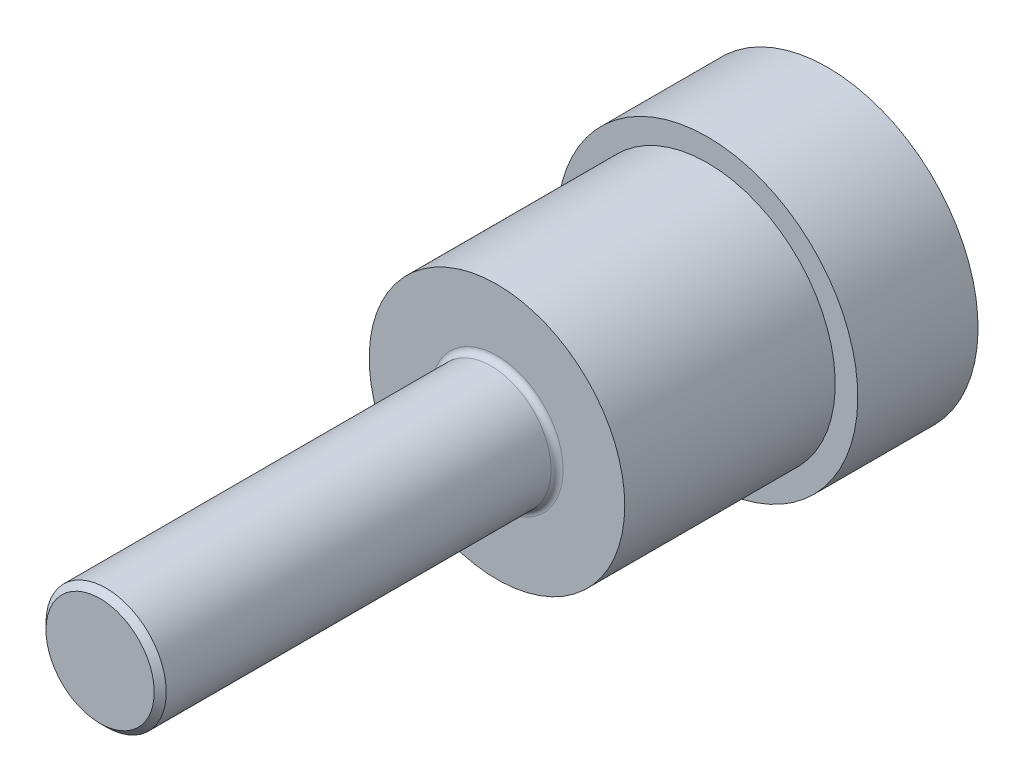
ISO-10303-21;
HEADER;
FILE_DESCRIPTION(('STEP AP214'),'2;1');
FILE_NAME('part.step','',(''),(''),'','','');
FILE_SCHEMA(('AUTOMOTIVE_DESIGN { 1 0 10303 214 1 1 1 1 }'));
ENDSEC;
DATA;
#1=APPLICATION_CONTEXT('core data for automotive mechanical design processes');
#2=APPLICATION_PROTOCOL_DEFINITION('international standard','automotive_design',2000,#1);
#3=PRODUCT_CONTEXT('',#1,'mechanical');
#4=PRODUCT('Part','Part','',(#3));
#5=PRODUCT_RELATED_PRODUCT_CATEGORY('part','',(#4));
#6=PRODUCT_DEFINITION_FORMATION('','',#4);
#7=PRODUCT_DEFINITION_CONTEXT('part definition',#1,'design');
#8=PRODUCT_DEFINITION('design','',#6,#7);
#9=PRODUCT_DEFINITION_SHAPE('','',#8);
#10=(LENGTH_UNIT() NAMED_UNIT(*) SI_UNIT(.MILLI.,.METRE.));
#11=(NAMED_UNIT(*) PLANE_ANGLE_UNIT() SI_UNIT($,.RADIAN.));
#12=(NAMED_UNIT(*) SI_UNIT($,.STERADIAN.) SOLID_ANGLE_UNIT());
#13=UNCERTAINTY_MEASURE_WITH_UNIT(LENGTH_MEASURE(1.E-05),#10,'distance_accuracy_value','');
#14=(GEOMETRIC_REPRESENTATION_CONTEXT(3) GLOBAL_UNCERTAINTY_ASSIGNED_CONTEXT((#13)) GLOBAL_UNIT_ASSIGNED_CONTEXT((#10,
#11,#12)) REPRESENTATION_CONTEXT('',''));
#15=CARTESIAN_POINT('',(0.,0.,0.));
#16=DIRECTION('',(0.,0.,1.));
#17=DIRECTION('',(1.,0.,0.));
#18=AXIS2_PLACEMENT_3D('',#15,#16,#17);
#19=CARTESIAN_POINT('',(0.,0.,-2.));
#20=DIRECTION('',(0.,0.,-1.));
#21=DIRECTION('',(0.,-1.,0.));
#22=AXIS2_PLACEMENT_3D('',#19,#20,#21);
#23=PLANE('',#22);
#24=CARTESIAN_POINT('',(0.,0.,-2.));
#25=DIRECTION('',(0.,0.,-1.));
#26=DIRECTION('',(0.,1.,0.));
#27=AXIS2_PLACEMENT_3D('',#24,#25,#26);
#28=CIRCLE('',#27,4.25);
#29=CARTESIAN_POINT('',(0.,4.25,-2.));
#30=VERTEX_POINT('',#29);
#31=EDGE_CURVE('E9',#30,#30,#28,.F.);
#32=ORIENTED_EDGE('',*,*,#31,.F.);
#33=EDGE_LOOP('',(#32));
#34=FACE_BOUND('',#33,.T.);
#35=CARTESIAN_POINT('',(0.,0.,-2.));
#36=DIRECTION('',(0.,0.,-1.));
#37=DIRECTION('',(0.,1.,0.));
#38=AXIS2_PLACEMENT_3D('',#35,#36,#37);
#39=CIRCLE('',#38,5.);
#40=CARTESIAN_POINT('',(0.,5.,-2.));
#41=VERTEX_POINT('',#40);
#42=EDGE_CURVE('E104',#41,#41,#39,.T.);
#43=ORIENTED_EDGE('',*,*,#42,.F.);
#44=EDGE_LOOP('',(#43));
#45=FACE_BOUND('',#44,.T.);
#46=ADVANCED_FACE('F14',(#34,#45),#23,.F.);
#47=CARTESIAN_POINT('',(0.,0.,-6.));
#48=DIRECTION('',(0.,0.,1.));
#49=DIRECTION('',(0.,1.,0.));
#50=AXIS2_PLACEMENT_3D('',#47,#48,#49);
#51=CYLINDRICAL_SURFACE('',#50,5.);
#52=CARTESIAN_POINT('',(0.,0.,-6.));
#53=DIRECTION('',(0.,0.,-1.));
#54=DIRECTION('',(0.,1.,0.));
#55=AXIS2_PLACEMENT_3D('',#52,#53,#54);
#56=CIRCLE('',#55,5.);
#57=CARTESIAN_POINT('',(0.,5.,-6.));
#58=VERTEX_POINT('',#57);
#59=EDGE_CURVE('E222',#58,#58,#56,.T.);
#60=ORIENTED_EDGE('',*,*,#59,.F.);
#61=EDGE_LOOP('',(#60));
#62=FACE_BOUND('',#61,.T.);
#63=ORIENTED_EDGE('',*,*,#42,.T.);
#64=EDGE_LOOP('',(#63));
#65=FACE_BOUND('',#64,.T.);
#66=ADVANCED_FACE('F166',(#62,#65),#51,.T.);
#67=CARTESIAN_POINT('',(0.,0.,-6.));
#68=DIRECTION('',(0.,0.,-1.));
#69=DIRECTION('',(0.,-1.,0.));
#70=AXIS2_PLACEMENT_3D('',#67,#68,#69);
#71=PLANE('',#70);
#72=CARTESIAN_POINT('',(0.,0.,-6.));
#73=DIRECTION('',(0.,0.,-1.));
#74=DIRECTION('',(0.,1.,0.));
#75=AXIS2_PLACEMENT_3D('',#72,#73,#74);
#76=CIRCLE('',#75,3.);
#77=CARTESIAN_POINT('',(0.,3.,-6.));
#78=VERTEX_POINT('',#77);
#79=EDGE_CURVE('E219',#78,#78,#76,.T.);
#80=ORIENTED_EDGE('',*,*,#79,.F.);
#81=EDGE_LOOP('',(#80));
#82=FACE_BOUND('',#81,.T.);
#83=ORIENTED_EDGE('',*,*,#59,.T.);
#84=EDGE_LOOP('',(#83));
#85=FACE_BOUND('',#84,.T.);
#86=ADVANCED_FACE('F173',(#82,#85),#71,.T.);
#87=CARTESIAN_POINT('',(0.,0.,-3.5));
#88=DIRECTION('',(0.,0.,-1.));
#89=DIRECTION('',(-1.,0.,0.));
#90=AXIS2_PLACEMENT_3D('',#87,#88,#89);
#91=PLANE('',#90);
#92=DIRECTION('',(0.866025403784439,0.5,0.));
#93=VECTOR('',#92,1.);
#94=CARTESIAN_POINT('',(-1.,0.577350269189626,-3.5));
#95=LINE('',#94,#93);
#96=CARTESIAN_POINT('',(-1.,0.577350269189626,-3.5));
#97=VERTEX_POINT('',#96);
#98=CARTESIAN_POINT('',(0.,1.15470053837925,-3.5));
#99=VERTEX_POINT('',#98);
#100=EDGE_CURVE('E115',#97,#99,#95,.T.);
#101=ORIENTED_EDGE('',*,*,#100,.T.);
#102=DIRECTION('',(0.866025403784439,-0.5,0.));
#103=VECTOR('',#102,1.);
#104=CARTESIAN_POINT('',(0.,1.15470053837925,-3.5));
#105=LINE('',#104,#103);
#106=CARTESIAN_POINT('',(1.,0.577350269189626,-3.5));
#107=VERTEX_POINT('',#106);
#108=EDGE_CURVE('E97',#99,#107,#105,.T.);
#109=ORIENTED_EDGE('',*,*,#108,.T.);
#110=DIRECTION('',(0.,-1.,0.));
#111=VECTOR('',#110,1.);
#112=CARTESIAN_POINT('',(1.,0.577350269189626,-3.5));
#113=LINE('',#112,#111);
#114=CARTESIAN_POINT('',(1.,-0.577350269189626,-3.5));
#115=VERTEX_POINT('',#114);
#116=EDGE_CURVE('E95',#107,#115,#113,.T.);
#117=ORIENTED_EDGE('',*,*,#116,.T.);
#118=DIRECTION('',(-0.866025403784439,-0.5,0.));
#119=VECTOR('',#118,1.);
#120=CARTESIAN_POINT('',(1.,-0.577350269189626,-3.5));
#121=LINE('',#120,#119);
#122=CARTESIAN_POINT('',(0.,-1.15470053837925,-3.5));
#123=VERTEX_POINT('',#122);
#124=EDGE_CURVE('E74',#115,#123,#121,.T.);
#125=ORIENTED_EDGE('',*,*,#124,.T.);
#126=DIRECTION('',(-0.866025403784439,0.5,0.));
#127=VECTOR('',#126,1.);
#128=CARTESIAN_POINT('',(0.,-1.15470053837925,-3.5));
#129=LINE('',#128,#127);
#130=CARTESIAN_POINT('',(-1.,-0.577350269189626,-3.5));
#131=VERTEX_POINT('',#130);
#132=EDGE_CURVE('E85',#123,#131,#129,.T.);
#133=ORIENTED_EDGE('',*,*,#132,.T.);
#134=DIRECTION('',(0.,1.,0.));
#135=VECTOR('',#134,1.);
#136=CARTESIAN_POINT('',(-1.,-0.577350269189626,-3.5));
#137=LINE('',#136,#135);
#138=EDGE_CURVE('E89',#131,#97,#137,.T.);
#139=ORIENTED_EDGE('',*,*,#138,.T.);
#140=EDGE_LOOP('',(#101,#109,#117,#125,#133,#139));
#141=FACE_BOUND('',#140,.T.);
#142=ADVANCED_FACE('F92',(#141),#91,.T.);
#143=CARTESIAN_POINT('',(0.,1.15470053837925,-3.5));
#144=DIRECTION('',(0.5,0.866025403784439,0.));
#145=DIRECTION('',(0.866025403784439,-0.5,0.));
#146=AXIS2_PLACEMENT_3D('',#143,#144,#145);
#147=PLANE('',#146);
#148=DIRECTION('',(0.866025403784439,-0.5,0.));
#149=VECTOR('',#148,1.);
#150=CARTESIAN_POINT('',(0.,1.15470053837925,-5.));
#151=LINE('',#150,#149);
#152=CARTESIAN_POINT('',(0.,1.15470053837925,-5.));
#153=VERTEX_POINT('',#152);
#154=CARTESIAN_POINT('',(1.,0.577350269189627,-5.));
#155=VERTEX_POINT('',#154);
#156=EDGE_CURVE('E103',#153,#155,#151,.T.);
#157=ORIENTED_EDGE('',*,*,#156,.T.);
#158=DIRECTION('',(0.,0.,-1.));
#159=VECTOR('',#158,1.);
#160=CARTESIAN_POINT('',(1.,0.577350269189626,-3.5));
#161=LINE('',#160,#159);
#162=EDGE_CURVE('E120',#107,#155,#161,.T.);
#163=ORIENTED_EDGE('',*,*,#162,.F.);
#164=ORIENTED_EDGE('',*,*,#108,.F.);
#165=DIRECTION('',(0.,0.,-1.));
#166=VECTOR('',#165,1.);
#167=CARTESIAN_POINT('',(0.,1.15470053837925,-3.5));
#168=LINE('',#167,#166);
#169=EDGE_CURVE('E59',#99,#153,#168,.T.);
#170=ORIENTED_EDGE('',*,*,#169,.T.);
#171=EDGE_LOOP('',(#157,#163,#164,#170));
#172=FACE_BOUND('',#171,.T.);
#173=ADVANCED_FACE('F144',(#172),#147,.F.);
#174=CARTESIAN_POINT('',(1.,0.577350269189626,-3.5));
#175=DIRECTION('',(1.,0.,0.));
#176=DIRECTION('',(0.,0.,-1.));
#177=AXIS2_PLACEMENT_3D('',#174,#175,#176);
#178=PLANE('',#177);
#179=DIRECTION('',(0.,-1.,0.));
#180=VECTOR('',#179,1.);
#181=CARTESIAN_POINT('',(1.,0.577350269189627,-5.));
#182=LINE('',#181,#180);
#183=CARTESIAN_POINT('',(1.,-0.577350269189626,-5.));
#184=VERTEX_POINT('',#183);
#185=EDGE_CURVE('E107',#155,#184,#182,.T.);
#186=ORIENTED_EDGE('',*,*,#185,.T.);
#187=DIRECTION('',(0.,0.,-1.));
#188=VECTOR('',#187,1.);
#189=CARTESIAN_POINT('',(1.,-0.577350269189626,-3.5));
#190=LINE('',#189,#188);
#191=EDGE_CURVE('E82',#115,#184,#190,.T.);
#192=ORIENTED_EDGE('',*,*,#191,.F.);
#193=ORIENTED_EDGE('',*,*,#116,.F.);
#194=ORIENTED_EDGE('',*,*,#162,.T.);
#195=EDGE_LOOP('',(#186,#192,#193,#194));
#196=FACE_BOUND('',#195,.T.);
#197=ADVANCED_FACE('F148',(#196),#178,.F.);
#198=CARTESIAN_POINT('',(1.,-0.577350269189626,-3.5));
#199=DIRECTION('',(0.5,-0.866025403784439,0.));
#200=DIRECTION('',(-0.866025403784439,-0.5,0.));
#201=AXIS2_PLACEMENT_3D('',#198,#199,#200);
#202=PLANE('',#201);
#203=DIRECTION('',(-0.866025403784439,-0.5,0.));
#204=VECTOR('',#203,1.);
#205=CARTESIAN_POINT('',(1.,-0.577350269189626,-5.));
#206=LINE('',#205,#204);
#207=CARTESIAN_POINT('',(0.,-1.15470053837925,-5.));
#208=VERTEX_POINT('',#207);
#209=EDGE_CURVE('E77',#184,#208,#206,.T.);
#210=ORIENTED_EDGE('',*,*,#209,.T.);
#211=DIRECTION('',(0.,0.,-1.));
#212=VECTOR('',#211,1.);
#213=CARTESIAN_POINT('',(0.,-1.15470053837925,-3.5));
#214=LINE('',#213,#212);
#215=EDGE_CURVE('E70',#123,#208,#214,.T.);
#216=ORIENTED_EDGE('',*,*,#215,.F.);
#217=ORIENTED_EDGE('',*,*,#124,.F.);
#218=ORIENTED_EDGE('',*,*,#191,.T.);
#219=EDGE_LOOP('',(#210,#216,#217,#218));
#220=FACE_BOUND('',#219,.T.);
#221=ADVANCED_FACE('F72',(#220),#202,.F.);
#222=CARTESIAN_POINT('',(0.,-1.15470053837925,-3.5));
#223=DIRECTION('',(-0.5,-0.866025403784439,0.));
#224=DIRECTION('',(-0.866025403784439,0.5,0.));
#225=AXIS2_PLACEMENT_3D('',#222,#223,#224);
#226=PLANE('',#225);
#227=DIRECTION('',(-0.866025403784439,0.5,0.));
#228=VECTOR('',#227,1.);
#229=CARTESIAN_POINT('',(0.,-1.15470053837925,-5.));
#230=LINE('',#229,#228);
#231=CARTESIAN_POINT('',(-1.,-0.577350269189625,-5.));
#232=VERTEX_POINT('',#231);
#233=EDGE_CURVE('E111',#208,#232,#230,.T.);
#234=ORIENTED_EDGE('',*,*,#233,.T.);
#235=DIRECTION('',(0.,0.,-1.));
#236=VECTOR('',#235,1.);
#237=CARTESIAN_POINT('',(-1.,-0.577350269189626,-3.5));
#238=LINE('',#237,#236);
#239=EDGE_CURVE('E81',#131,#232,#238,.T.);
#240=ORIENTED_EDGE('',*,*,#239,.F.);
#241=ORIENTED_EDGE('',*,*,#132,.F.);
#242=ORIENTED_EDGE('',*,*,#215,.T.);
#243=EDGE_LOOP('',(#234,#240,#241,#242));
#244=FACE_BOUND('',#243,.T.);
#245=ADVANCED_FACE('F86',(#244),#226,.F.);
#246=CARTESIAN_POINT('',(-1.,-0.577350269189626,-3.5));
#247=DIRECTION('',(-1.,0.,0.));
#248=DIRECTION('',(0.,0.,1.));
#249=AXIS2_PLACEMENT_3D('',#246,#247,#248);
#250=PLANE('',#249);
#251=DIRECTION('',(0.,1.,0.));
#252=VECTOR('',#251,1.);
#253=CARTESIAN_POINT('',(-1.,-0.577350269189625,-5.));
#254=LINE('',#253,#252);
#255=CARTESIAN_POINT('',(-1.,0.577350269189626,-5.));
#256=VERTEX_POINT('',#255);
#257=EDGE_CURVE('E113',#232,#256,#254,.T.);
#258=ORIENTED_EDGE('',*,*,#257,.T.);
#259=DIRECTION('',(0.,0.,-1.));
#260=VECTOR('',#259,1.);
#261=CARTESIAN_POINT('',(-1.,0.577350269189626,-3.5));
#262=LINE('',#261,#260);
#263=EDGE_CURVE('E37',#97,#256,#262,.T.);
#264=ORIENTED_EDGE('',*,*,#263,.F.);
#265=ORIENTED_EDGE('',*,*,#138,.F.);
#266=ORIENTED_EDGE('',*,*,#239,.T.);
#267=EDGE_LOOP('',(#258,#264,#265,#266));
#268=FACE_BOUND('',#267,.T.);
#269=ADVANCED_FACE('F152',(#268),#250,.F.);
#270=CARTESIAN_POINT('',(-1.,0.577350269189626,-3.5));
#271=DIRECTION('',(-0.5,0.866025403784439,0.));
#272=DIRECTION('',(0.866025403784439,0.5,0.));
#273=AXIS2_PLACEMENT_3D('',#270,#271,#272);
#274=PLANE('',#273);
#275=DIRECTION('',(0.866025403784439,0.5,0.));
#276=VECTOR('',#275,1.);
#277=CARTESIAN_POINT('',(-1.,0.577350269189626,-5.));
#278=LINE('',#277,#276);
#279=EDGE_CURVE('E29',#256,#153,#278,.T.);
#280=ORIENTED_EDGE('',*,*,#279,.T.);
#281=ORIENTED_EDGE('',*,*,#169,.F.);
#282=ORIENTED_EDGE('',*,*,#100,.F.);
#283=ORIENTED_EDGE('',*,*,#263,.T.);
#284=EDGE_LOOP('',(#280,#281,#282,#283));
#285=FACE_BOUND('',#284,.T.);
#286=ADVANCED_FACE('F154',(#285),#274,.F.);
#287=CARTESIAN_POINT('',(0.,0.,-5.));
#288=DIRECTION('',(0.,0.,-1.));
#289=DIRECTION('',(-1.,0.,0.));
#290=AXIS2_PLACEMENT_3D('',#287,#288,#289);
#291=PLANE('',#290);
#292=ORIENTED_EDGE('',*,*,#279,.F.);
#293=ORIENTED_EDGE('',*,*,#257,.F.);
#294=ORIENTED_EDGE('',*,*,#233,.F.);
#295=ORIENTED_EDGE('',*,*,#209,.F.);
#296=ORIENTED_EDGE('',*,*,#185,.F.);
#297=ORIENTED_EDGE('',*,*,#156,.F.);
#298=EDGE_LOOP('',(#292,#293,#294,#295,#296,#297));
#299=FACE_BOUND('',#298,.T.);
#300=CARTESIAN_POINT('',(0.,0.,-5.));
#301=DIRECTION('',(0.,0.,-1.));
#302=DIRECTION('',(-1.,0.,0.));
#303=AXIS2_PLACEMENT_3D('',#300,#301,#302);
#304=CIRCLE('',#303,2.75);
#305=CARTESIAN_POINT('',(-2.75,0.,-5.00000000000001));
#306=VERTEX_POINT('',#305);
#307=EDGE_CURVE('E117',#306,#306,#304,.T.);
#308=ORIENTED_EDGE('',*,*,#307,.T.);
#309=EDGE_LOOP('',(#308));
#310=FACE_BOUND('',#309,.T.);
#311=ADVANCED_FACE('F150',(#299,#310),#291,.T.);
#312=CARTESIAN_POINT('',(0.,0.,-11.));
#313=DIRECTION('',(0.,0.,-1.));
#314=DIRECTION('',(-1.,0.,0.));
#315=AXIS2_PLACEMENT_3D('',#312,#313,#314);
#316=CYLINDRICAL_SURFACE('',#315,2.75);
#317=CARTESIAN_POINT('',(0.,0.,-3.));
#318=DIRECTION('',(0.,0.,-1.));
#319=DIRECTION('',(0.,1.,0.));
#320=AXIS2_PLACEMENT_3D('',#317,#318,#319);
#321=CIRCLE('',#320,2.75);
#322=CARTESIAN_POINT('',(0.,2.75,-3.));
#323=VERTEX_POINT('',#322);
#324=EDGE_CURVE('E22',#323,#323,#321,.T.);
#325=ORIENTED_EDGE('',*,*,#324,.T.);
#326=EDGE_LOOP('',(#325));
#327=FACE_BOUND('',#326,.T.);
#328=ORIENTED_EDGE('',*,*,#307,.F.);
#329=EDGE_LOOP('',(#328));
#330=FACE_BOUND('',#329,.T.);
#331=ADVANCED_FACE('F16',(#327,#330),#316,.T.);
#332=CARTESIAN_POINT('',(0.,0.,-3.));
#333=DIRECTION('',(0.,0.,-1.));
#334=DIRECTION('',(0.,-1.,0.));
#335=AXIS2_PLACEMENT_3D('',#332,#333,#334);
#336=PLANE('',#335);
#337=ORIENTED_EDGE('',*,*,#324,.F.);
#338=EDGE_LOOP('',(#337));
#339=FACE_BOUND('',#338,.T.);
#340=CARTESIAN_POINT('',(0.,0.,-3.));
#341=DIRECTION('',(0.,0.,-1.));
#342=DIRECTION('',(0.,-1.,0.));
#343=AXIS2_PLACEMENT_3D('',#340,#341,#342);
#344=CIRCLE('',#343,3.);
#345=CARTESIAN_POINT('',(0.,-3.,-3.));
#346=VERTEX_POINT('',#345);
#347=EDGE_CURVE('E142',#346,#346,#344,.T.);
#348=ORIENTED_EDGE('',*,*,#347,.T.);
#349=EDGE_LOOP('',(#348));
#350=FACE_BOUND('',#349,.T.);
#351=ADVANCED_FACE('F236',(#339,#350),#336,.T.);
#352=CARTESIAN_POINT('',(0.,0.,-3.));
#353=DIRECTION('',(0.,0.,-1.));
#354=DIRECTION('',(0.,-1.,0.));
#355=AXIS2_PLACEMENT_3D('',#352,#353,#354);
#356=CYLINDRICAL_SURFACE('',#355,3.);
#357=ORIENTED_EDGE('',*,*,#347,.F.);
#358=EDGE_LOOP('',(#357));
#359=FACE_BOUND('',#358,.T.);
#360=ORIENTED_EDGE('',*,*,#79,.T.);
#361=EDGE_LOOP('',(#360));
#362=FACE_BOUND('',#361,.T.);
#363=ADVANCED_FACE('F185',(#359,#362),#356,.F.);
#364=CARTESIAN_POINT('',(0.,0.,-2.));
#365=DIRECTION('',(0.,0.,-1.));
#366=DIRECTION('',(0.,1.,0.));
#367=AXIS2_PLACEMENT_3D('',#364,#365,#366);
#368=CYLINDRICAL_SURFACE('',#367,4.25);
#369=ORIENTED_EDGE('',*,*,#31,.T.);
#370=EDGE_LOOP('',(#369));
#371=FACE_BOUND('',#370,.T.);
#372=CARTESIAN_POINT('',(0.,0.,5.));
#373=DIRECTION('',(0.,0.,1.));
#374=DIRECTION('',(1.,0.,0.));
#375=AXIS2_PLACEMENT_3D('',#372,#373,#374);
#376=CIRCLE('',#375,4.25);
#377=CARTESIAN_POINT('',(4.25,0.,5.));
#378=VERTEX_POINT('',#377);
#379=EDGE_CURVE('E226',#378,#378,#376,.T.);
#380=ORIENTED_EDGE('',*,*,#379,.F.);
#381=EDGE_LOOP('',(#380));
#382=FACE_BOUND('',#381,.T.);
#383=ADVANCED_FACE('F181',(#371,#382),#368,.T.);
#384=CARTESIAN_POINT('',(0.,0.,18.2));
#385=DIRECTION('',(0.,0.,1.));
#386=DIRECTION('',(0.,-1.,0.));
#387=AXIS2_PLACEMENT_3D('',#384,#385,#386);
#388=PLANE('',#387);
#389=CARTESIAN_POINT('',(0.,0.,18.2));
#390=DIRECTION('',(0.,0.,1.));
#391=DIRECTION('',(0.,-1.,0.));
#392=AXIS2_PLACEMENT_3D('',#389,#390,#391);
#393=CIRCLE('',#392,1.8);
#394=CARTESIAN_POINT('',(0.,-1.8,18.2));
#395=VERTEX_POINT('',#394);
#396=EDGE_CURVE('E127',#395,#395,#393,.T.);
#397=ORIENTED_EDGE('',*,*,#396,.T.);
#398=EDGE_LOOP('',(#397));
#399=FACE_BOUND('',#398,.T.);
#400=ADVANCED_FACE('F184',(#399),#388,.T.);
#401=CARTESIAN_POINT('',(0.,0.,18.));
#402=DIRECTION('',(0.,0.,-1.));
#403=DIRECTION('',(0.,1.,0.));
#404=AXIS2_PLACEMENT_3D('',#401,#402,#403);
#405=CONICAL_SURFACE('',#404,2.,0.785398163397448);
#406=ORIENTED_EDGE('',*,*,#396,.F.);
#407=EDGE_LOOP('',(#406));
#408=FACE_BOUND('',#407,.T.);
#409=CARTESIAN_POINT('',(0.,0.,18.));
#410=DIRECTION('',(0.,0.,1.));
#411=DIRECTION('',(0.,-1.,0.));
#412=AXIS2_PLACEMENT_3D('',#409,#410,#411);
#413=CIRCLE('',#412,2.);
#414=CARTESIAN_POINT('',(0.,-2.,18.));
#415=VERTEX_POINT('',#414);
#416=EDGE_CURVE('E123',#415,#415,#413,.F.);
#417=ORIENTED_EDGE('',*,*,#416,.F.);
#418=EDGE_LOOP('',(#417));
#419=FACE_BOUND('',#418,.T.);
#420=ADVANCED_FACE('F195',(#408,#419),#405,.T.);
#421=CARTESIAN_POINT('',(0.,0.,-2.));
#422=DIRECTION('',(0.,0.,-1.));
#423=DIRECTION('',(0.,1.,0.));
#424=AXIS2_PLACEMENT_3D('',#421,#422,#423);
#425=CYLINDRICAL_SURFACE('',#424,2.);
#426=CARTESIAN_POINT('',(0.,0.,5.2));
#427=DIRECTION('',(0.,0.,1.));
#428=DIRECTION('',(0.,-1.,0.));
#429=AXIS2_PLACEMENT_3D('',#426,#427,#428);
#430=CIRCLE('',#429,2.);
#431=CARTESIAN_POINT('',(0.,-2.,5.2));
#432=VERTEX_POINT('',#431);
#433=EDGE_CURVE('E139',#432,#432,#430,.T.);
#434=ORIENTED_EDGE('',*,*,#433,.T.);
#435=EDGE_LOOP('',(#434));
#436=FACE_BOUND('',#435,.T.);
#437=ORIENTED_EDGE('',*,*,#416,.T.);
#438=EDGE_LOOP('',(#437));
#439=FACE_BOUND('',#438,.T.);
#440=ADVANCED_FACE('F192',(#436,#439),#425,.T.);
#441=CARTESIAN_POINT('',(0.,0.,5.2));
#442=DIRECTION('',(0.,0.,1.));
#443=DIRECTION('',(0.,-1.,0.));
#444=AXIS2_PLACEMENT_3D('',#441,#442,#443);
#445=TOROIDAL_SURFACE('',#444,2.2,0.2);
#446=ORIENTED_EDGE('',*,*,#433,.F.);
#447=EDGE_LOOP('',(#446));
#448=FACE_BOUND('',#447,.T.);
#449=CARTESIAN_POINT('',(0.,0.,5.));
#450=DIRECTION('',(0.,0.,1.));
#451=DIRECTION('',(0.,-1.,0.));
#452=AXIS2_PLACEMENT_3D('',#449,#450,#451);
#453=CIRCLE('',#452,2.2);
#454=CARTESIAN_POINT('',(0.,-2.2,5.));
#455=VERTEX_POINT('',#454);
#456=EDGE_CURVE('E132',#455,#455,#453,.F.);
#457=ORIENTED_EDGE('',*,*,#456,.F.);
#458=EDGE_LOOP('',(#457));
#459=FACE_BOUND('',#458,.T.);
#460=ADVANCED_FACE('F190',(#448,#459),#445,.F.);
#461=CARTESIAN_POINT('',(4.25,0.,5.));
#462=DIRECTION('',(0.,0.,1.));
#463=DIRECTION('',(0.,-1.,0.));
#464=AXIS2_PLACEMENT_3D('',#461,#462,#463);
#465=PLANE('',#464);
#466=ORIENTED_EDGE('',*,*,#456,.T.);
#467=EDGE_LOOP('',(#466));
#468=FACE_BOUND('',#467,.T.);
#469=ORIENTED_EDGE('',*,*,#379,.T.);
#470=EDGE_LOOP('',(#469));
#471=FACE_BOUND('',#470,.T.);
#472=ADVANCED_FACE('F187',(#468,#471),#465,.T.);
#473=CLOSED_SHELL('',(#46,#66,#86,#142,#173,#197,#221,#245,#269,#286,#311,#331,#351,#363,#383,
#400,#420,#440,#460,#472));
#474=MANIFOLD_SOLID_BREP('B1',#473);
#475=ADVANCED_BREP_SHAPE_REPRESENTATION('',(#18,#474),#14);
#476=SHAPE_DEFINITION_REPRESENTATION(#9,#475);
ENDSEC;
END-ISO-10303-21;
